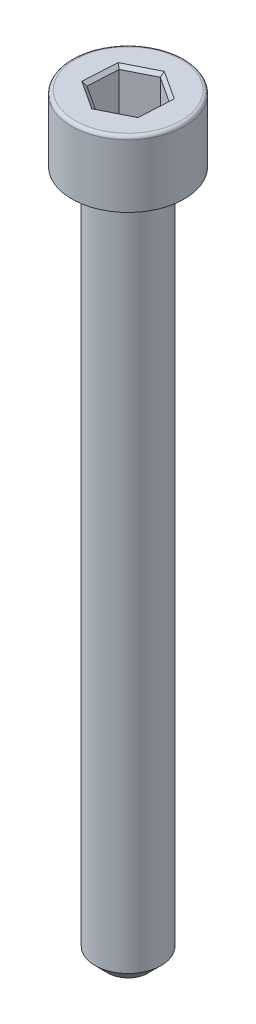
ISO-10303-21;
HEADER;
FILE_DESCRIPTION(('STEP AP214'),'2;1');
FILE_NAME('part.step','',(''),(''),'','','');
FILE_SCHEMA(('AUTOMOTIVE_DESIGN { 1 0 10303 214 1 1 1 1 }'));
ENDSEC;
DATA;
#1=APPLICATION_CONTEXT('core data for automotive mechanical design processes');
#2=APPLICATION_PROTOCOL_DEFINITION('international standard','automotive_design',2000,#1);
#3=PRODUCT_CONTEXT('',#1,'mechanical');
#4=PRODUCT('Part','Part','',(#3));
#5=PRODUCT_RELATED_PRODUCT_CATEGORY('part','',(#4));
#6=PRODUCT_DEFINITION_FORMATION('','',#4);
#7=PRODUCT_DEFINITION_CONTEXT('part definition',#1,'design');
#8=PRODUCT_DEFINITION('design','',#6,#7);
#9=PRODUCT_DEFINITION_SHAPE('','',#8);
#10=(LENGTH_UNIT() NAMED_UNIT(*) SI_UNIT(.MILLI.,.METRE.));
#11=(NAMED_UNIT(*) PLANE_ANGLE_UNIT() SI_UNIT($,.RADIAN.));
#12=(NAMED_UNIT(*) SI_UNIT($,.STERADIAN.) SOLID_ANGLE_UNIT());
#13=UNCERTAINTY_MEASURE_WITH_UNIT(LENGTH_MEASURE(1.E-05),#10,'distance_accuracy_value','');
#14=(GEOMETRIC_REPRESENTATION_CONTEXT(3) GLOBAL_UNCERTAINTY_ASSIGNED_CONTEXT((#13)) GLOBAL_UNIT_ASSIGNED_CONTEXT((#10,
#11,#12)) REPRESENTATION_CONTEXT('',''));
#15=CARTESIAN_POINT('',(0.,0.,0.));
#16=DIRECTION('',(0.,0.,1.));
#17=DIRECTION('',(1.,0.,0.));
#18=AXIS2_PLACEMENT_3D('',#15,#16,#17);
#19=CARTESIAN_POINT('',(-13.0119064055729,28.35,8.5401323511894));
#20=DIRECTION('',(-0.387508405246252,-0.707106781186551,0.59147040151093));
#21=DIRECTION('',(0.836465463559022,0.,0.548019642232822));
#22=AXIS2_PLACEMENT_3D('',#19,#20,#21);
#23=PLANE('',#22);
#24=DIRECTION('',(-0.674917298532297,0.654653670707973,0.340463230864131));
#25=VECTOR('',#24,1.);
#26=CARTESIAN_POINT('',(-13.0119064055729,28.35,8.5401323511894));
#27=LINE('',#26,#25);
#28=CARTESIAN_POINT('',(-13.0119064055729,28.35,8.5401323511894));
#29=VERTEX_POINT('',#28);
#30=CARTESIAN_POINT('',(-13.2696447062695,28.6,8.67014889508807));
#31=VERTEX_POINT('',#30);
#32=EDGE_CURVE('E24',#29,#31,#27,.T.);
#33=ORIENTED_EDGE('',*,*,#32,.T.);
#34=DIRECTION('',(-0.836465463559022,0.,-0.548019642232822));
#35=VECTOR('',#34,1.);
#36=CARTESIAN_POINT('',(-12.1830441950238,28.6,9.3820472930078));
#37=LINE('',#36,#35);
#38=CARTESIAN_POINT('',(-11.0964436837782,28.6,10.0939456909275));
#39=VERTEX_POINT('',#38);
#40=EDGE_CURVE('E215',#39,#31,#37,.T.);
#41=ORIENTED_EDGE('',*,*,#40,.F.);
#42=DIRECTION('',(0.042608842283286,-0.654653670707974,-0.7547271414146));
#43=VECTOR('',#42,1.);
#44=CARTESIAN_POINT('',(-11.0429801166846,27.7785714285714,9.14694964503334));
#45=LINE('',#44,#43);
#46=CARTESIAN_POINT('',(-11.0801721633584,28.35,9.80572950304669));
#47=VERTEX_POINT('',#46);
#48=EDGE_CURVE('E11',#39,#47,#45,.T.);
#49=ORIENTED_EDGE('',*,*,#48,.T.);
#50=DIRECTION('',(0.836465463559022,0.,0.548019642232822));
#51=VECTOR('',#50,1.);
#52=CARTESIAN_POINT('',(-13.0119064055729,28.35,8.5401323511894));
#53=LINE('',#52,#51);
#54=EDGE_CURVE('E247',#29,#47,#53,.T.);
#55=ORIENTED_EDGE('',*,*,#54,.F.);
#56=EDGE_LOOP('',(#33,#41,#49,#55));
#57=FACE_BOUND('',#56,.T.);
#58=ADVANCED_FACE('F16',(#57),#23,.F.);
#59=CARTESIAN_POINT('',(-11.0801721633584,28.35,9.80572950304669));
#60=DIRECTION('',(0.318474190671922,-0.707106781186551,0.631327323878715));
#61=DIRECTION('',(0.892831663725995,0.,-0.450390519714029));
#62=AXIS2_PLACEMENT_3D('',#59,#60,#61);
#63=PLANE('',#62);
#64=DIRECTION('',(-0.632308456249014,-0.654653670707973,-0.414263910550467));
#65=VECTOR('',#64,1.);
#66=CARTESIAN_POINT('',(-9.01826575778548,28.35,8.76559715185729));
#67=LINE('',#66,#65);
#68=CARTESIAN_POINT('',(-8.77679897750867,28.6,8.92379679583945));
#69=VERTEX_POINT('',#68);
#70=CARTESIAN_POINT('',(-9.01826575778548,28.35,8.76559715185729));
#71=VERTEX_POINT('',#70);
#72=EDGE_CURVE('E368',#69,#71,#67,.T.);
#73=ORIENTED_EDGE('',*,*,#72,.T.);
#74=DIRECTION('',(0.892831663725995,0.,-0.450390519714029));
#75=VECTOR('',#74,1.);
#76=CARTESIAN_POINT('',(-11.0801721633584,28.35,9.80572950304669));
#77=LINE('',#76,#75);
#78=EDGE_CURVE('E309',#47,#71,#77,.T.);
#79=ORIENTED_EDGE('',*,*,#78,.F.);
#80=ORIENTED_EDGE('',*,*,#48,.F.);
#81=DIRECTION('',(-0.892831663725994,0.,0.450390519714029));
#82=VECTOR('',#81,1.);
#83=CARTESIAN_POINT('',(-9.93662133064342,28.6,9.50887124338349));
#84=LINE('',#83,#82);
#85=EDGE_CURVE('E219',#69,#39,#84,.T.);
#86=ORIENTED_EDGE('',*,*,#85,.F.);
#87=EDGE_LOOP('',(#73,#79,#80,#86));
#88=FACE_BOUND('',#87,.T.);
#89=ADVANCED_FACE('F387',(#88),#63,.F.);
#90=CARTESIAN_POINT('',(-12.8817342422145,28.35,6.23440284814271));
#91=DIRECTION('',(-0.705982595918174,-0.707106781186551,-0.039856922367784));
#92=DIRECTION('',(-0.0563662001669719,0.,0.998410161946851));
#93=AXIS2_PLACEMENT_3D('',#90,#91,#92);
#94=PLANE('',#93);
#95=DIRECTION('',(-0.632308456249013,0.654653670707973,-0.414263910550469));
#96=VECTOR('',#95,1.);
#97=CARTESIAN_POINT('',(-12.8817342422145,28.35,6.23440284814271));
#98=LINE('',#97,#96);
#99=CARTESIAN_POINT('',(-12.8817342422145,28.35,6.23440284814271));
#100=VERTEX_POINT('',#99);
#101=CARTESIAN_POINT('',(-13.1232010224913,28.6,6.07620320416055));
#102=VERTEX_POINT('',#101);
#103=EDGE_CURVE('E365',#100,#102,#98,.T.);
#104=ORIENTED_EDGE('',*,*,#103,.T.);
#105=DIRECTION('',(0.0563662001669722,0.,-0.998410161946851));
#106=VECTOR('',#105,1.);
#107=CARTESIAN_POINT('',(-13.1964228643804,28.6,7.37317604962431));
#108=LINE('',#107,#106);
#109=EDGE_CURVE('E201',#31,#102,#108,.T.);
#110=ORIENTED_EDGE('',*,*,#109,.F.);
#111=ORIENTED_EDGE('',*,*,#32,.F.);
#112=DIRECTION('',(-0.0563662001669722,0.,0.998410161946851));
#113=VECTOR('',#112,1.);
#114=CARTESIAN_POINT('',(-12.8817342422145,28.35,6.23440284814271));
#115=LINE('',#114,#113);
#116=EDGE_CURVE('E257',#100,#29,#115,.T.);
#117=ORIENTED_EDGE('',*,*,#116,.F.);
#118=EDGE_LOOP('',(#104,#110,#111,#117));
#119=FACE_BOUND('',#118,.T.);
#120=ADVANCED_FACE('F379',(#119),#94,.F.);
#121=CARTESIAN_POINT('',(-9.01826575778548,28.35,8.76559715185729));
#122=DIRECTION('',(0.705982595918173,-0.707106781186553,0.0398569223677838));
#123=DIRECTION('',(0.0563662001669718,0.,-0.998410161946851));
#124=AXIS2_PLACEMENT_3D('',#121,#122,#123);
#125=PLANE('',#124);
#126=DIRECTION('',(-0.674917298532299,-0.654653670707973,0.340463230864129));
#127=VECTOR('',#126,1.);
#128=CARTESIAN_POINT('',(-8.88809359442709,28.35,6.4598676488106));
#129=LINE('',#128,#127);
#130=CARTESIAN_POINT('',(-8.63035529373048,28.6,6.32985110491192));
#131=VERTEX_POINT('',#130);
#132=CARTESIAN_POINT('',(-8.88809359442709,28.35,6.4598676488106));
#133=VERTEX_POINT('',#132);
#134=EDGE_CURVE('E327',#131,#133,#129,.T.);
#135=ORIENTED_EDGE('',*,*,#134,.T.);
#136=DIRECTION('',(0.0563662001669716,0.,-0.998410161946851));
#137=VECTOR('',#136,1.);
#138=CARTESIAN_POINT('',(-9.01826575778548,28.35,8.76559715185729));
#139=LINE('',#138,#137);
#140=EDGE_CURVE('E301',#71,#133,#139,.T.);
#141=ORIENTED_EDGE('',*,*,#140,.F.);
#142=ORIENTED_EDGE('',*,*,#72,.F.);
#143=DIRECTION('',(-0.0563662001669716,0.,0.998410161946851));
#144=VECTOR('',#143,1.);
#145=CARTESIAN_POINT('',(-8.70357713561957,28.6,7.62682395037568));
#146=LINE('',#145,#144);
#147=EDGE_CURVE('E187',#131,#69,#146,.T.);
#148=ORIENTED_EDGE('',*,*,#147,.F.);
#149=EDGE_LOOP('',(#135,#141,#142,#148));
#150=FACE_BOUND('',#149,.T.);
#151=ADVANCED_FACE('F415',(#150),#125,.F.);
#152=CARTESIAN_POINT('',(-10.8198278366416,28.35,5.19427049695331));
#153=DIRECTION('',(-0.318474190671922,-0.707106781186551,-0.631327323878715));
#154=DIRECTION('',(-0.892831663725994,0.,0.450390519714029));
#155=AXIS2_PLACEMENT_3D('',#152,#153,#154);
#156=PLANE('',#155);
#157=DIRECTION('',(0.0426088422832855,0.654653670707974,-0.754727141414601));
#158=VECTOR('',#157,1.);
#159=CARTESIAN_POINT('',(-10.8198278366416,28.35,5.19427049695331));
#160=LINE('',#159,#158);
#161=CARTESIAN_POINT('',(-10.8198278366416,28.35,5.19427049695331));
#162=VERTEX_POINT('',#161);
#163=CARTESIAN_POINT('',(-10.8035563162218,28.6,4.90605430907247));
#164=VERTEX_POINT('',#163);
#165=EDGE_CURVE('E330',#162,#164,#160,.T.);
#166=ORIENTED_EDGE('',*,*,#165,.T.);
#167=DIRECTION('',(0.892831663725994,0.,-0.450390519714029));
#168=VECTOR('',#167,1.);
#169=CARTESIAN_POINT('',(-11.9633786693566,28.6,5.49112875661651));
#170=LINE('',#169,#168);
#171=EDGE_CURVE('E188',#102,#164,#170,.T.);
#172=ORIENTED_EDGE('',*,*,#171,.F.);
#173=ORIENTED_EDGE('',*,*,#103,.F.);
#174=DIRECTION('',(-0.892831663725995,0.,0.450390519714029));
#175=VECTOR('',#174,1.);
#176=CARTESIAN_POINT('',(-10.8198278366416,28.35,5.19427049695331));
#177=LINE('',#176,#175);
#178=EDGE_CURVE('E269',#162,#100,#177,.T.);
#179=ORIENTED_EDGE('',*,*,#178,.F.);
#180=EDGE_LOOP('',(#166,#172,#173,#179));
#181=FACE_BOUND('',#180,.T.);
#182=ADVANCED_FACE('F406',(#181),#156,.F.);
#183=CARTESIAN_POINT('',(-8.88809359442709,28.35,6.4598676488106));
#184=DIRECTION('',(0.387508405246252,-0.707106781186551,-0.591470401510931));
#185=DIRECTION('',(-0.836465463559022,0.,-0.548019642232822));
#186=AXIS2_PLACEMENT_3D('',#183,#184,#185);
#187=PLANE('',#186);
#188=ORIENTED_EDGE('',*,*,#134,.F.);
#189=DIRECTION('',(0.836465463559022,0.,0.548019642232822));
#190=VECTOR('',#189,1.);
#191=CARTESIAN_POINT('',(-9.71695580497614,28.6,5.6179527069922));
#192=LINE('',#191,#190);
#193=EDGE_CURVE('E185',#164,#131,#192,.T.);
#194=ORIENTED_EDGE('',*,*,#193,.F.);
#195=ORIENTED_EDGE('',*,*,#165,.F.);
#196=DIRECTION('',(-0.836465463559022,0.,-0.548019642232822));
#197=VECTOR('',#196,1.);
#198=CARTESIAN_POINT('',(-8.88809359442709,28.35,6.4598676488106));
#199=LINE('',#198,#197);
#200=EDGE_CURVE('E289',#133,#162,#199,.T.);
#201=ORIENTED_EDGE('',*,*,#200,.F.);
#202=EDGE_LOOP('',(#188,#194,#195,#201));
#203=FACE_BOUND('',#202,.T.);
#204=ADVANCED_FACE('F412',(#203),#187,.F.);
#205=CARTESIAN_POINT('',(-12.769136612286,25.35,6.45761076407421));
#206=DIRECTION('',(-0.892831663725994,0.,0.450390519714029));
#207=DIRECTION('',(-0.450390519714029,0.,-0.892831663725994));
#208=AXIS2_PLACEMENT_3D('',#205,#206,#207);
#209=CYLINDRICAL_SURFACE('',#208,0.25);
#210=CARTESIAN_POINT('',(-10.8360993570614,25.1,5.48248668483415));
#211=CARTESIAN_POINT('',(-10.8265677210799,25.1,5.31365355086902));
#212=CARTESIAN_POINT('',(-10.8198278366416,25.2035533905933,5.19427049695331));
#213=CARTESIAN_POINT('',(-10.8198278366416,25.35,5.19427049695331));
#214=(BOUNDED_CURVE() B_SPLINE_CURVE(3,(#210,#211,#212,#213),.UNSPECIFIED.,.F.,
.F.) B_SPLINE_CURVE_WITH_KNOTS((4,4),(1.5707963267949,3.1415926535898),
.UNSPECIFIED.) CURVE() GEOMETRIC_REPRESENTATION_ITEM() RATIONAL_B_SPLINE_CURVE((1.,
0.804737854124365,0.804737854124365,1.)) REPRESENTATION_ITEM(''));
#215=CARTESIAN_POINT('',(-10.8360993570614,25.1,5.48248668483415));
#216=VERTEX_POINT('',#215);
#217=CARTESIAN_POINT('',(-10.8198278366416,25.35,5.19427049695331));
#218=VERTEX_POINT('',#217);
#219=EDGE_CURVE('E130',#216,#218,#214,.T.);
#220=ORIENTED_EDGE('',*,*,#219,.T.);
#221=DIRECTION('',(0.892831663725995,0.,-0.450390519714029));
#222=VECTOR('',#221,1.);
#223=CARTESIAN_POINT('',(-10.8198278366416,25.35,5.19427049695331));
#224=LINE('',#223,#222);
#225=CARTESIAN_POINT('',(-12.8817342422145,25.35,6.23440284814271));
#226=VERTEX_POINT('',#225);
#227=EDGE_CURVE('E281',#226,#218,#224,.T.);
#228=ORIENTED_EDGE('',*,*,#227,.F.);
#229=CARTESIAN_POINT('',(-12.8817342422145,25.35,6.23440284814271));
#230=CARTESIAN_POINT('',(-12.8817342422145,25.2035533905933,6.23440284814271));
#231=CARTESIAN_POINT('',(-12.7817154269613,25.1,6.29993128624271));
#232=CARTESIAN_POINT('',(-12.6402674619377,25.1,6.39260249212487));
#233=(BOUNDED_CURVE() B_SPLINE_CURVE(3,(#229,#230,#231,#232),.UNSPECIFIED.,.F.,
.F.) B_SPLINE_CURVE_WITH_KNOTS((4,4),(0.,1.5707963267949),
.UNSPECIFIED.) CURVE() GEOMETRIC_REPRESENTATION_ITEM() RATIONAL_B_SPLINE_CURVE((1.,
0.804737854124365,0.804737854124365,1.)) REPRESENTATION_ITEM(''));
#234=CARTESIAN_POINT('',(-12.6402674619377,25.1,6.39260249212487));
#235=VERTEX_POINT('',#234);
#236=EDGE_CURVE('E140',#226,#235,#233,.T.);
#237=ORIENTED_EDGE('',*,*,#236,.T.);
#238=DIRECTION('',(-0.892831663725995,0.,0.450390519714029));
#239=VECTOR('',#238,1.);
#240=CARTESIAN_POINT('',(-12.769136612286,25.1,6.45761076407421));
#241=LINE('',#240,#239);
#242=EDGE_CURVE('E202',#216,#235,#241,.T.);
#243=ORIENTED_EDGE('',*,*,#242,.F.);
#244=EDGE_LOOP('',(#220,#228,#237,#243));
#245=FACE_BOUND('',#244,.T.);
#246=ADVANCED_FACE('F493',(#245),#209,.F.);
#247=CARTESIAN_POINT('',(-12.8273899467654,25.35,9.70708865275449));
#248=DIRECTION('',(-0.0563662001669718,0.,0.998410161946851));
#249=DIRECTION('',(-0.998410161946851,0.,-0.0563662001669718));
#250=AXIS2_PLACEMENT_3D('',#247,#248,#249);
#251=CYLINDRICAL_SURFACE('',#250,0.25);
#252=CARTESIAN_POINT('',(-13.0119064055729,25.35,8.5401323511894));
#253=CARTESIAN_POINT('',(-13.0119064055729,25.2035533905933,8.54013235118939));
#254=CARTESIAN_POINT('',(-12.9051477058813,25.1,8.48627773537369));
#255=CARTESIAN_POINT('',(-12.7541681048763,25.1,8.41011580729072));
#256=(BOUNDED_CURVE() B_SPLINE_CURVE(3,(#252,#253,#254,#255),.UNSPECIFIED.,.F.,
.F.) B_SPLINE_CURVE_WITH_KNOTS((4,4),(0.,1.5707963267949),
.UNSPECIFIED.) CURVE() GEOMETRIC_REPRESENTATION_ITEM() RATIONAL_B_SPLINE_CURVE((1.,
0.804737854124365,0.804737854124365,1.)) REPRESENTATION_ITEM(''));
#257=CARTESIAN_POINT('',(-13.0119064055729,25.35,8.5401323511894));
#258=VERTEX_POINT('',#257);
#259=CARTESIAN_POINT('',(-12.7541681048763,25.1,8.41011580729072));
#260=VERTEX_POINT('',#259);
#261=EDGE_CURVE('E237',#258,#260,#256,.T.);
#262=ORIENTED_EDGE('',*,*,#261,.T.);
#263=DIRECTION('',(-0.0563662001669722,0.,0.998410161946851));
#264=VECTOR('',#263,1.);
#265=CARTESIAN_POINT('',(-12.8273899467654,25.1,9.70708865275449));
#266=LINE('',#265,#264);
#267=EDGE_CURVE('E206',#235,#260,#266,.T.);
#268=ORIENTED_EDGE('',*,*,#267,.F.);
#269=ORIENTED_EDGE('',*,*,#236,.F.);
#270=DIRECTION('',(0.0563662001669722,0.,-0.998410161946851));
#271=VECTOR('',#270,1.);
#272=CARTESIAN_POINT('',(-12.8817342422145,25.35,6.23440284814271));
#273=LINE('',#272,#271);
#274=EDGE_CURVE('E261',#258,#226,#273,.T.);
#275=ORIENTED_EDGE('',*,*,#274,.F.);
#276=EDGE_LOOP('',(#262,#268,#269,#275));
#277=FACE_BOUND('',#276,.T.);
#278=ADVANCED_FACE('F490',(#277),#251,.F.);
#279=CARTESIAN_POINT('',(-9.0250985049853,25.35,6.66898401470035));
#280=DIRECTION('',(-0.836465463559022,0.,-0.548019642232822));
#281=DIRECTION('',(0.548019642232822,0.,-0.836465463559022));
#282=AXIS2_PLACEMENT_3D('',#279,#280,#281);
#283=CYLINDRICAL_SURFACE('',#282,0.25);
#284=CARTESIAN_POINT('',(-9.14583189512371,25.1,6.58988419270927));
#285=CARTESIAN_POINT('',(-8.99485229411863,25.1,6.5137222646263));
#286=CARTESIAN_POINT('',(-8.88809359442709,25.2035533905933,6.4598676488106));
#287=CARTESIAN_POINT('',(-8.88809359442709,25.35,6.4598676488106));
#288=(BOUNDED_CURVE() B_SPLINE_CURVE(3,(#284,#285,#286,#287),.UNSPECIFIED.,.F.,
.F.) B_SPLINE_CURVE_WITH_KNOTS((4,4),(4.71238898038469,6.28318530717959),
.UNSPECIFIED.) CURVE() GEOMETRIC_REPRESENTATION_ITEM() RATIONAL_B_SPLINE_CURVE((1.,
0.804737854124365,0.804737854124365,1.)) REPRESENTATION_ITEM(''));
#289=CARTESIAN_POINT('',(-9.14583189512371,25.1,6.58988419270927));
#290=VERTEX_POINT('',#289);
#291=CARTESIAN_POINT('',(-8.88809359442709,25.35,6.4598676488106));
#292=VERTEX_POINT('',#291);
#293=EDGE_CURVE('E274',#290,#292,#288,.T.);
#294=ORIENTED_EDGE('',*,*,#293,.T.);
#295=DIRECTION('',(0.836465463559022,0.,0.548019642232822));
#296=VECTOR('',#295,1.);
#297=CARTESIAN_POINT('',(-8.88809359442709,25.35,6.4598676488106));
#298=LINE('',#297,#296);
#299=EDGE_CURVE('E293',#218,#292,#298,.T.);
#300=ORIENTED_EDGE('',*,*,#299,.F.);
#301=ORIENTED_EDGE('',*,*,#219,.F.);
#302=DIRECTION('',(-0.836465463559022,0.,-0.548019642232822));
#303=VECTOR('',#302,1.);
#304=CARTESIAN_POINT('',(-9.0250985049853,25.1,6.66898401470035));
#305=LINE('',#304,#303);
#306=EDGE_CURVE('E207',#290,#216,#305,.T.);
#307=ORIENTED_EDGE('',*,*,#306,.F.);
#308=EDGE_LOOP('',(#294,#300,#301,#307));
#309=FACE_BOUND('',#308,.T.);
#310=ADVANCED_FACE('F424',(#309),#283,.F.);
#311=CARTESIAN_POINT('',(-10.9431672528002,25.35,9.59661313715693));
#312=DIRECTION('',(0.836465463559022,0.,0.548019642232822));
#313=DIRECTION('',(0.,-1.,0.));
#314=AXIS2_PLACEMENT_3D('',#311,#312,#313);
#315=CYLINDRICAL_SURFACE('',#314,0.25);
#316=CARTESIAN_POINT('',(-11.0801721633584,25.35,9.80572950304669));
#317=CARTESIAN_POINT('',(-11.0801721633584,25.2035533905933,9.80572950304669));
#318=CARTESIAN_POINT('',(-11.0734322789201,25.1,9.68634644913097));
#319=CARTESIAN_POINT('',(-11.0639006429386,25.1,9.51751331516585));
#320=(BOUNDED_CURVE() B_SPLINE_CURVE(3,(#316,#317,#318,#319),.UNSPECIFIED.,.F.,
.F.) B_SPLINE_CURVE_WITH_KNOTS((4,4),(0.,1.5707963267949),
.UNSPECIFIED.) CURVE() GEOMETRIC_REPRESENTATION_ITEM() RATIONAL_B_SPLINE_CURVE((1.,
0.804737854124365,0.804737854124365,1.)) REPRESENTATION_ITEM(''));
#321=CARTESIAN_POINT('',(-11.0801721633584,25.35,9.80572950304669));
#322=VERTEX_POINT('',#321);
#323=CARTESIAN_POINT('',(-11.0639006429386,25.1,9.51751331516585));
#324=VERTEX_POINT('',#323);
#325=EDGE_CURVE('E48',#322,#324,#320,.T.);
#326=ORIENTED_EDGE('',*,*,#325,.T.);
#327=DIRECTION('',(0.836465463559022,0.,0.548019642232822));
#328=VECTOR('',#327,1.);
#329=CARTESIAN_POINT('',(-10.9431672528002,25.1,9.59661313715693));
#330=LINE('',#329,#328);
#331=EDGE_CURVE('E220',#260,#324,#330,.T.);
#332=ORIENTED_EDGE('',*,*,#331,.F.);
#333=ORIENTED_EDGE('',*,*,#261,.F.);
#334=DIRECTION('',(-0.836465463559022,0.,-0.548019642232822));
#335=VECTOR('',#334,1.);
#336=CARTESIAN_POINT('',(-13.0119064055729,25.35,8.5401323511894));
#337=LINE('',#336,#335);
#338=EDGE_CURVE('E190',#322,#258,#337,.T.);
#339=ORIENTED_EDGE('',*,*,#338,.F.);
#340=EDGE_LOOP('',(#326,#332,#333,#339));
#341=FACE_BOUND('',#340,.T.);
#342=ADVANCED_FACE('F439',(#341),#315,.F.);
#343=CARTESIAN_POINT('',(-9.33295437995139,25.35,9.90437035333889));
#344=DIRECTION('',(0.0563662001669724,0.,-0.998410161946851));
#345=DIRECTION('',(0.998410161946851,0.,0.0563662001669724));
#346=AXIS2_PLACEMENT_3D('',#343,#344,#345);
#347=CYLINDRICAL_SURFACE('',#346,0.25);
#348=CARTESIAN_POINT('',(-9.2597325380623,25.1,8.60739750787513));
#349=CARTESIAN_POINT('',(-9.11828457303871,25.1,8.70006871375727));
#350=CARTESIAN_POINT('',(-9.01826575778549,25.2035533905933,8.76559715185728));
#351=CARTESIAN_POINT('',(-9.01826575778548,25.35,8.76559715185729));
#352=(BOUNDED_CURVE() B_SPLINE_CURVE(3,(#348,#349,#350,#351),.UNSPECIFIED.,.F.,
.F.) B_SPLINE_CURVE_WITH_KNOTS((4,4),(4.71238898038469,6.28318530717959),
.UNSPECIFIED.) CURVE() GEOMETRIC_REPRESENTATION_ITEM() RATIONAL_B_SPLINE_CURVE((1.,
0.804737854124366,0.804737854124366,1.)) REPRESENTATION_ITEM(''));
#353=CARTESIAN_POINT('',(-9.2597325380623,25.1,8.60739750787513));
#354=VERTEX_POINT('',#353);
#355=CARTESIAN_POINT('',(-9.01826575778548,25.35,8.76559715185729));
#356=VERTEX_POINT('',#355);
#357=EDGE_CURVE('E35',#354,#356,#352,.T.);
#358=ORIENTED_EDGE('',*,*,#357,.T.);
#359=DIRECTION('',(-0.0563662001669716,0.,0.998410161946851));
#360=VECTOR('',#359,1.);
#361=CARTESIAN_POINT('',(-9.01826575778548,25.35,8.76559715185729));
#362=LINE('',#361,#360);
#363=EDGE_CURVE('E305',#292,#356,#362,.T.);
#364=ORIENTED_EDGE('',*,*,#363,.F.);
#365=ORIENTED_EDGE('',*,*,#293,.F.);
#366=DIRECTION('',(0.0563662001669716,0.,-0.998410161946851));
#367=VECTOR('',#366,1.);
#368=CARTESIAN_POINT('',(-9.33295437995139,25.1,9.90437035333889));
#369=LINE('',#368,#367);
#370=EDGE_CURVE('E326',#354,#290,#369,.T.);
#371=ORIENTED_EDGE('',*,*,#370,.F.);
#372=EDGE_LOOP('',(#358,#364,#365,#371));
#373=FACE_BOUND('',#372,.T.);
#374=ADVANCED_FACE('F421',(#373),#347,.F.);
#375=CARTESIAN_POINT('',(-11.1927697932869,25.35,9.58252158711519));
#376=DIRECTION('',(0.892831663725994,0.,-0.450390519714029));
#377=DIRECTION('',(0.450390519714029,0.,0.892831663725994));
#378=AXIS2_PLACEMENT_3D('',#375,#376,#377);
#379=CYLINDRICAL_SURFACE('',#378,0.25);
#380=ORIENTED_EDGE('',*,*,#325,.F.);
#381=DIRECTION('',(-0.892831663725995,0.,0.450390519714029));
#382=VECTOR('',#381,1.);
#383=CARTESIAN_POINT('',(-11.0801721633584,25.35,9.80572950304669));
#384=LINE('',#383,#382);
#385=EDGE_CURVE('E313',#356,#322,#384,.T.);
#386=ORIENTED_EDGE('',*,*,#385,.F.);
#387=ORIENTED_EDGE('',*,*,#357,.F.);
#388=DIRECTION('',(0.892831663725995,0.,-0.450390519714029));
#389=VECTOR('',#388,1.);
#390=CARTESIAN_POINT('',(-11.1927697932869,25.1,9.58252158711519));
#391=LINE('',#390,#389);
#392=EDGE_CURVE('E224',#324,#354,#391,.T.);
#393=ORIENTED_EDGE('',*,*,#392,.F.);
#394=EDGE_LOOP('',(#380,#386,#387,#393));
#395=FACE_BOUND('',#394,.T.);
#396=ADVANCED_FACE('F427',(#395),#379,.F.);
#397=CARTESIAN_POINT('',(-10.95,28.35,7.5));
#398=DIRECTION('',(0.,-1.,0.));
#399=DIRECTION('',(-0.836465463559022,0.,-0.548019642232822));
#400=AXIS2_PLACEMENT_3D('',#397,#398,#399);
#401=TOROIDAL_SURFACE('',#400,4.,0.25);
#402=CARTESIAN_POINT('',(-10.95,28.6,7.5));
#403=DIRECTION('',(0.,1.,0.));
#404=DIRECTION('',(-0.836465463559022,0.,-0.548019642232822));
#405=AXIS2_PLACEMENT_3D('',#402,#403,#404);
#406=CIRCLE('',#405,4.);
#407=CARTESIAN_POINT('',(-14.2958618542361,28.6,5.30792143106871));
#408=VERTEX_POINT('',#407);
#409=EDGE_CURVE('E227',#408,#408,#406,.T.);
#410=ORIENTED_EDGE('',*,*,#409,.F.);
#411=EDGE_LOOP('',(#410));
#412=FACE_BOUND('',#411,.T.);
#413=CARTESIAN_POINT('',(-10.95,28.35,7.5));
#414=DIRECTION('',(0.,-1.,0.));
#415=DIRECTION('',(-0.836465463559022,0.,-0.548019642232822));
#416=AXIS2_PLACEMENT_3D('',#413,#414,#415);
#417=CIRCLE('',#416,4.25);
#418=CARTESIAN_POINT('',(-14.5049782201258,28.35,5.1709165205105));
#419=VERTEX_POINT('',#418);
#420=EDGE_CURVE('E210',#419,#419,#417,.T.);
#421=ORIENTED_EDGE('',*,*,#420,.F.);
#422=EDGE_LOOP('',(#421));
#423=FACE_BOUND('',#422,.T.);
#424=ADVANCED_FACE('F429',(#412,#423),#401,.T.);
#425=CARTESIAN_POINT('',(-10.95,-28.4,7.5));
#426=DIRECTION('',(0.,1.,0.));
#427=DIRECTION('',(0.836465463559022,0.,0.548019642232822));
#428=AXIS2_PLACEMENT_3D('',#425,#426,#427);
#429=CONICAL_SURFACE('',#428,1.50000000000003,0.785398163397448);
#430=CARTESIAN_POINT('',(-10.95,-28.4,7.5));
#431=DIRECTION('',(0.,-1.,0.));
#432=DIRECTION('',(-0.836465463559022,0.,-0.548019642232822));
#433=AXIS2_PLACEMENT_3D('',#430,#431,#432);
#434=CIRCLE('',#433,1.50000000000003);
#435=CARTESIAN_POINT('',(-12.2046981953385,-28.4,6.67797053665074));
#436=VERTEX_POINT('',#435);
#437=EDGE_CURVE('E157',#436,#436,#434,.T.);
#438=ORIENTED_EDGE('',*,*,#437,.F.);
#439=EDGE_LOOP('',(#438));
#440=FACE_BOUND('',#439,.T.);
#441=CARTESIAN_POINT('',(-10.95,-27.4,7.5));
#442=DIRECTION('',(0.,1.,0.));
#443=DIRECTION('',(-0.836465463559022,0.,-0.548019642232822));
#444=AXIS2_PLACEMENT_3D('',#441,#442,#443);
#445=CIRCLE('',#444,2.5);
#446=CARTESIAN_POINT('',(-13.0411636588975,-27.4,6.12995089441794));
#447=VERTEX_POINT('',#446);
#448=EDGE_CURVE('E178',#447,#447,#445,.T.);
#449=ORIENTED_EDGE('',*,*,#448,.F.);
#450=EDGE_LOOP('',(#449));
#451=FACE_BOUND('',#450,.T.);
#452=ADVANCED_FACE('F436',(#440,#451),#429,.T.);
#453=CARTESIAN_POINT('',(-11.0801721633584,25.1,9.80572950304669));
#454=DIRECTION('',(0.,1.,0.));
#455=DIRECTION('',(-0.548019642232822,0.,0.836465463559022));
#456=AXIS2_PLACEMENT_3D('',#453,#454,#455);
#457=PLANE('',#456);
#458=ORIENTED_EDGE('',*,*,#306,.T.);
#459=ORIENTED_EDGE('',*,*,#242,.T.);
#460=ORIENTED_EDGE('',*,*,#267,.T.);
#461=ORIENTED_EDGE('',*,*,#331,.T.);
#462=ORIENTED_EDGE('',*,*,#392,.T.);
#463=ORIENTED_EDGE('',*,*,#370,.T.);
#464=EDGE_LOOP('',(#458,#459,#460,#461,#462,#463));
#465=FACE_BOUND('',#464,.T.);
#466=ADVANCED_FACE('F426',(#465),#457,.T.);
#467=CARTESIAN_POINT('',(-11.0801721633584,25.1,9.80572950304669));
#468=DIRECTION('',(0.450390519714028,0.,0.892831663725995));
#469=DIRECTION('',(0.892831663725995,0.,-0.450390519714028));
#470=AXIS2_PLACEMENT_3D('',#467,#468,#469);
#471=PLANE('',#470);
#472=DIRECTION('',(0.,1.,0.));
#473=VECTOR('',#472,1.);
#474=CARTESIAN_POINT('',(-11.0801721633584,25.1,9.80572950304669));
#475=LINE('',#474,#473);
#476=EDGE_CURVE('E195',#322,#47,#475,.T.);
#477=ORIENTED_EDGE('',*,*,#476,.T.);
#478=ORIENTED_EDGE('',*,*,#78,.T.);
#479=DIRECTION('',(0.,1.,0.));
#480=VECTOR('',#479,1.);
#481=CARTESIAN_POINT('',(-9.01826575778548,25.1,8.76559715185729));
#482=LINE('',#481,#480);
#483=EDGE_CURVE('E297',#356,#71,#482,.T.);
#484=ORIENTED_EDGE('',*,*,#483,.F.);
#485=ORIENTED_EDGE('',*,*,#385,.T.);
#486=EDGE_LOOP('',(#477,#478,#484,#485));
#487=FACE_BOUND('',#486,.T.);
#488=ADVANCED_FACE('F393',(#487),#471,.F.);
#489=CARTESIAN_POINT('',(-9.01826575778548,25.1,8.76559715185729));
#490=DIRECTION('',(0.998410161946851,0.,0.0563662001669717));
#491=DIRECTION('',(0.,-1.,0.));
#492=AXIS2_PLACEMENT_3D('',#489,#490,#491);
#493=PLANE('',#492);
#494=ORIENTED_EDGE('',*,*,#483,.T.);
#495=ORIENTED_EDGE('',*,*,#140,.T.);
#496=DIRECTION('',(0.,1.,0.));
#497=VECTOR('',#496,1.);
#498=CARTESIAN_POINT('',(-8.88809359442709,25.1,6.4598676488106));
#499=LINE('',#498,#497);
#500=EDGE_CURVE('E285',#292,#133,#499,.T.);
#501=ORIENTED_EDGE('',*,*,#500,.F.);
#502=ORIENTED_EDGE('',*,*,#363,.T.);
#503=EDGE_LOOP('',(#494,#495,#501,#502));
#504=FACE_BOUND('',#503,.T.);
#505=ADVANCED_FACE('F418',(#504),#493,.F.);
#506=CARTESIAN_POINT('',(-8.88809359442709,25.1,6.4598676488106));
#507=DIRECTION('',(0.548019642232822,0.,-0.836465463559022));
#508=DIRECTION('',(-0.836465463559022,0.,-0.548019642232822));
#509=AXIS2_PLACEMENT_3D('',#506,#507,#508);
#510=PLANE('',#509);
#511=ORIENTED_EDGE('',*,*,#500,.T.);
#512=ORIENTED_EDGE('',*,*,#200,.T.);
#513=DIRECTION('',(0.,1.,0.));
#514=VECTOR('',#513,1.);
#515=CARTESIAN_POINT('',(-10.8198278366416,25.1,5.19427049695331));
#516=LINE('',#515,#514);
#517=EDGE_CURVE('E265',#218,#162,#516,.T.);
#518=ORIENTED_EDGE('',*,*,#517,.F.);
#519=ORIENTED_EDGE('',*,*,#299,.T.);
#520=EDGE_LOOP('',(#511,#512,#518,#519));
#521=FACE_BOUND('',#520,.T.);
#522=ADVANCED_FACE('F423',(#521),#510,.F.);
#523=CARTESIAN_POINT('',(-10.8198278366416,25.1,5.19427049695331));
#524=DIRECTION('',(-0.450390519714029,0.,-0.892831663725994));
#525=DIRECTION('',(0.,1.,0.));
#526=AXIS2_PLACEMENT_3D('',#523,#524,#525);
#527=PLANE('',#526);
#528=ORIENTED_EDGE('',*,*,#517,.T.);
#529=ORIENTED_EDGE('',*,*,#178,.T.);
#530=DIRECTION('',(0.,1.,0.));
#531=VECTOR('',#530,1.);
#532=CARTESIAN_POINT('',(-12.8817342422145,25.1,6.23440284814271));
#533=LINE('',#532,#531);
#534=EDGE_CURVE('E194',#226,#100,#533,.T.);
#535=ORIENTED_EDGE('',*,*,#534,.F.);
#536=ORIENTED_EDGE('',*,*,#227,.T.);
#537=EDGE_LOOP('',(#528,#529,#535,#536));
#538=FACE_BOUND('',#537,.T.);
#539=ADVANCED_FACE('F402',(#538),#527,.F.);
#540=CARTESIAN_POINT('',(-12.8817342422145,25.1,6.23440284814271));
#541=DIRECTION('',(-0.998410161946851,0.,-0.056366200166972));
#542=DIRECTION('',(0.,1.,0.));
#543=AXIS2_PLACEMENT_3D('',#540,#541,#542);
#544=PLANE('',#543);
#545=ORIENTED_EDGE('',*,*,#534,.T.);
#546=ORIENTED_EDGE('',*,*,#116,.T.);
#547=DIRECTION('',(0.,1.,0.));
#548=VECTOR('',#547,1.);
#549=CARTESIAN_POINT('',(-13.0119064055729,25.1,8.5401323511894));
#550=LINE('',#549,#548);
#551=EDGE_CURVE('E214',#258,#29,#550,.T.);
#552=ORIENTED_EDGE('',*,*,#551,.F.);
#553=ORIENTED_EDGE('',*,*,#274,.T.);
#554=EDGE_LOOP('',(#545,#546,#552,#553));
#555=FACE_BOUND('',#554,.T.);
#556=ADVANCED_FACE('F398',(#555),#544,.F.);
#557=CARTESIAN_POINT('',(-13.0119064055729,25.1,8.5401323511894));
#558=DIRECTION('',(-0.548019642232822,0.,0.836465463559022));
#559=DIRECTION('',(0.,1.,0.));
#560=AXIS2_PLACEMENT_3D('',#557,#558,#559);
#561=PLANE('',#560);
#562=ORIENTED_EDGE('',*,*,#551,.T.);
#563=ORIENTED_EDGE('',*,*,#54,.T.);
#564=ORIENTED_EDGE('',*,*,#476,.F.);
#565=ORIENTED_EDGE('',*,*,#338,.T.);
#566=EDGE_LOOP('',(#562,#563,#564,#565));
#567=FACE_BOUND('',#566,.T.);
#568=ADVANCED_FACE('F395',(#567),#561,.F.);
#569=CARTESIAN_POINT('',(-10.95,28.6,7.5));
#570=DIRECTION('',(0.,-1.,0.));
#571=DIRECTION('',(-0.836465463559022,0.,-0.548019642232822));
#572=AXIS2_PLACEMENT_3D('',#569,#570,#571);
#573=PLANE('',#572);
#574=ORIENTED_EDGE('',*,*,#85,.T.);
#575=ORIENTED_EDGE('',*,*,#40,.T.);
#576=ORIENTED_EDGE('',*,*,#109,.T.);
#577=ORIENTED_EDGE('',*,*,#171,.T.);
#578=ORIENTED_EDGE('',*,*,#193,.T.);
#579=ORIENTED_EDGE('',*,*,#147,.T.);
#580=EDGE_LOOP('',(#574,#575,#576,#577,#578,#579));
#581=FACE_BOUND('',#580,.T.);
#582=ORIENTED_EDGE('',*,*,#409,.T.);
#583=EDGE_LOOP('',(#582));
#584=FACE_BOUND('',#583,.T.);
#585=ADVANCED_FACE('F382',(#581,#584),#573,.F.);
#586=CARTESIAN_POINT('',(-10.95,28.6,7.5));
#587=DIRECTION('',(0.,-1.,0.));
#588=DIRECTION('',(-0.836465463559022,0.,-0.548019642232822));
#589=AXIS2_PLACEMENT_3D('',#586,#587,#588);
#590=CYLINDRICAL_SURFACE('',#589,4.25);
#591=ORIENTED_EDGE('',*,*,#420,.T.);
#592=EDGE_LOOP('',(#591));
#593=FACE_BOUND('',#592,.T.);
#594=CARTESIAN_POINT('',(-10.95,23.6,7.5));
#595=DIRECTION('',(0.,-1.,0.));
#596=DIRECTION('',(-0.836465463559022,0.,-0.548019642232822));
#597=AXIS2_PLACEMENT_3D('',#594,#595,#596);
#598=CIRCLE('',#597,4.25);
#599=CARTESIAN_POINT('',(-14.5049782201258,23.6,5.1709165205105));
#600=VERTEX_POINT('',#599);
#601=EDGE_CURVE('E149',#600,#600,#598,.T.);
#602=ORIENTED_EDGE('',*,*,#601,.F.);
#603=EDGE_LOOP('',(#602));
#604=FACE_BOUND('',#603,.T.);
#605=ADVANCED_FACE('F463',(#593,#604),#590,.T.);
#606=CARTESIAN_POINT('',(-10.95,23.6,7.5));
#607=DIRECTION('',(0.,-1.,0.));
#608=DIRECTION('',(-0.836465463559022,0.,-0.548019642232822));
#609=AXIS2_PLACEMENT_3D('',#606,#607,#608);
#610=PLANE('',#609);
#611=CARTESIAN_POINT('',(-10.95,23.6,7.5));
#612=DIRECTION('',(0.,-1.,0.));
#613=DIRECTION('',(-0.836465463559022,0.,-0.548019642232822));
#614=AXIS2_PLACEMENT_3D('',#611,#612,#613);
#615=CIRCLE('',#614,2.5);
#616=CARTESIAN_POINT('',(-13.0411636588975,23.6,6.12995089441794));
#617=VERTEX_POINT('',#616);
#618=EDGE_CURVE('E174',#617,#617,#615,.T.);
#619=ORIENTED_EDGE('',*,*,#618,.F.);
#620=EDGE_LOOP('',(#619));
#621=FACE_BOUND('',#620,.T.);
#622=ORIENTED_EDGE('',*,*,#601,.T.);
#623=EDGE_LOOP('',(#622));
#624=FACE_BOUND('',#623,.T.);
#625=ADVANCED_FACE('F460',(#621,#624),#610,.T.);
#626=CARTESIAN_POINT('',(-10.95,-28.4,7.5));
#627=DIRECTION('',(0.,-1.,0.));
#628=DIRECTION('',(-0.836465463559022,0.,-0.548019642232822));
#629=AXIS2_PLACEMENT_3D('',#626,#627,#628);
#630=PLANE('',#629);
#631=ORIENTED_EDGE('',*,*,#437,.T.);
#632=EDGE_LOOP('',(#631));
#633=FACE_BOUND('',#632,.T.);
#634=ADVANCED_FACE('F456',(#633),#630,.T.);
#635=CARTESIAN_POINT('',(-10.95,-28.4,7.5));
#636=DIRECTION('',(0.,1.,0.));
#637=DIRECTION('',(0.836465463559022,0.,0.548019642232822));
#638=AXIS2_PLACEMENT_3D('',#635,#636,#637);
#639=CYLINDRICAL_SURFACE('',#638,2.5);
#640=ORIENTED_EDGE('',*,*,#448,.T.);
#641=EDGE_LOOP('',(#640));
#642=FACE_BOUND('',#641,.T.);
#643=ORIENTED_EDGE('',*,*,#618,.T.);
#644=EDGE_LOOP('',(#643));
#645=FACE_BOUND('',#644,.T.);
#646=ADVANCED_FACE('F175',(#642,#645),#639,.T.);
#647=CLOSED_SHELL('',(#58,#89,#120,#151,#182,#204,#246,#278,#310,#342,#374,#396,#424,#452,#466,
#488,#505,#522,#539,#556,#568,#585,#605,#625,#634,#646));
#648=MANIFOLD_SOLID_BREP('B1',#647);
#649=ADVANCED_BREP_SHAPE_REPRESENTATION('',(#18,#648),#14);
#650=SHAPE_DEFINITION_REPRESENTATION(#9,#649);
ENDSEC;
END-ISO-10303-21;
